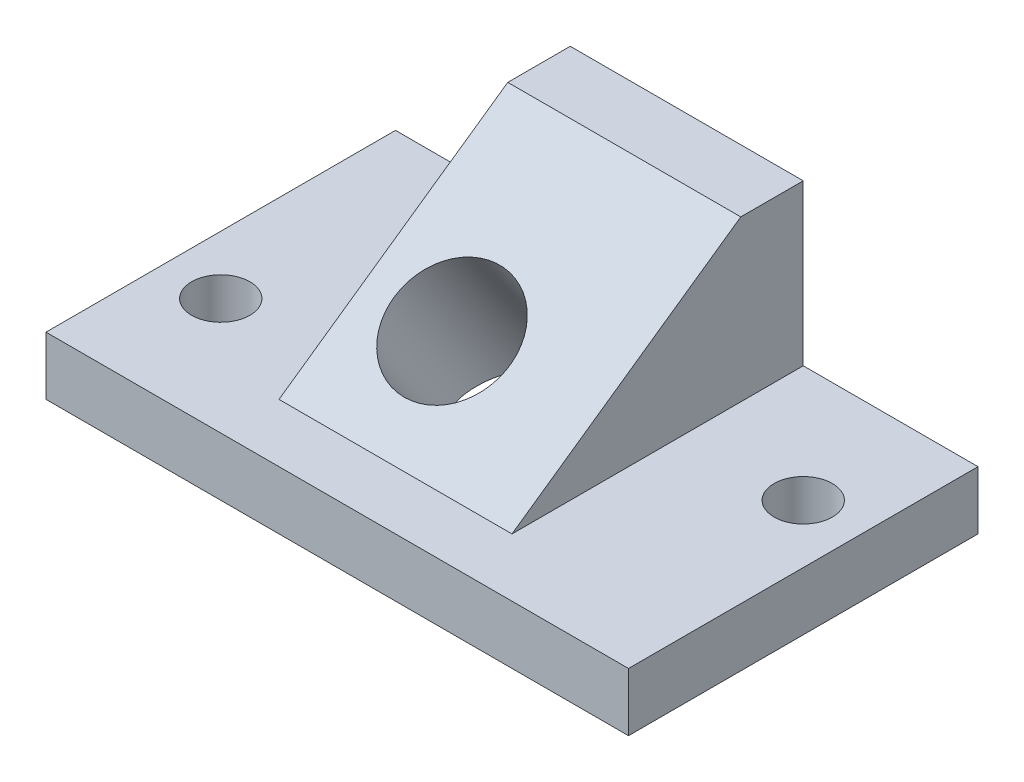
from build123d import *

# Parameters (mm, degrees)
SKETCH1_W           = 127
SKETCH1_H           = 76.2
BASE_EXTRUDE_DEPTH  = 12.7
BOSS_EXTRUDE2_DEPTH = 25.4
SKETCH4_R           = 6.35
CUT_EXTRUDE1_DEPTH  = 143.281881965
SKETCH5_R           = 12.7
CUT_EXTRUDE2_DEPTH  = 87.70998064


with BuildPart() as part:
    # Sketch1 → Base-Extrude (new body)
    with BuildSketch(Plane(origin=(0, 0, 0), x_dir=(1, 0, 0), z_dir=(0, 1, 0))):
        Rectangle(SKETCH1_W, SKETCH1_H)
    extrude(amount=BASE_EXTRUDE_DEPTH)

    # Sketch3 → Boss-Extrude2 (add, symmetric)
    with BuildSketch(Plane(origin=(0, 0, 0), x_dir=(0, 0, -1), z_dir=(1, 0, 0))):
        Polygon((-25.4, 12.7), (24.478069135, 47.625), (38.1, 47.625), (38.1, 12.7), align=None)
    extrude(amount=BOSS_EXTRUDE2_DEPTH, both=True)

    # Sketch4 → Cut-Extrude1 (cut, through all)
    with BuildSketch(Plane(origin=(65.699574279, 12.7, 10.189215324), x_dir=(-1, 0, 0), z_dir=(0, 1, 0))):
        with Locations(Location((14.899574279, -22.889215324, 0), (0, 0, 90))):
            Circle(SKETCH4_R)
        with Locations(Location((116.499574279, 2.510784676, 0), (0, 0, 90))):
            Circle(SKETCH4_R)
    extrude(amount=-CUT_EXTRUDE1_DEPTH, mode=Mode.SUBTRACT)

    # Sketch5 → Cut-Extrude2 (cut, through all)
    with BuildSketch(Plane(origin=(0, 20.455924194, 14.323392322), x_dir=(-1, 0, 0), z_dir=(0, 0.8191520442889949, 0.5735764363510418))):
        with Locations(Location((6.35, -9.267838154, 0), (0, 0, 90))):
            Circle(SKETCH5_R)
    extrude(amount=-CUT_EXTRUDE2_DEPTH, mode=Mode.SUBTRACT)


solid = part.part
